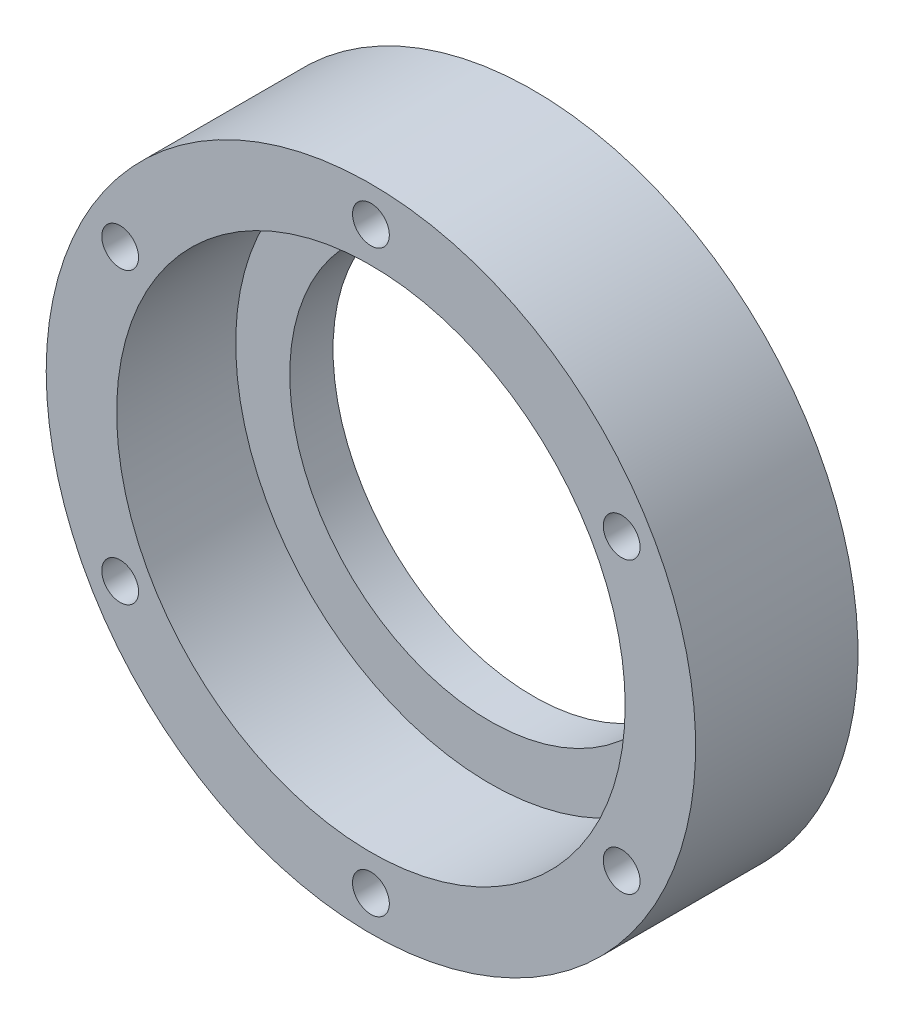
from build123d import *

# Parameters (mm, degrees)
SKETCH1_W             = 30
SKETCH1_H             = 15
F_4_CLEARANCE_HOLE1_D = 3.4
HOLE1_D               = 37
HOLE1_CBORE_D         = 46.98238
HOLE1_CBORE_DEPTH     = 11
CHAMFER1_SIZE         = 1.45


with BuildPart() as part:
    # Sketch1 → Revolve1 (revolve)
    with BuildSketch(Plane.XZ, mode=Mode.PRIVATE) as revolve1_sk:
        with Locations((15, 7.5)):
            Rectangle(SKETCH1_W, SKETCH1_H)
    revolve(revolve1_sk.sketch.rotate(Axis((0, 0, 15), (0, 0, -1)), 180), axis=Axis((0, 0, 15), (0, 0, -1)))

    # 4 Clearance Hole1 (through all)
    with Locations(Plane(origin=(0, 0, 0), x_dir=(-1, 0, 0), z_dir=(0, 0, -1))):
        with Locations((-23.166179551, -13.375), (-23.166179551, 13.375), (0, 26.75), (23.166179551, -13.375), (0, -26.75), (23.166179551, 13.375)):
            Hole(F_4_CLEARANCE_HOLE1_D / 2)

    # Hole1 (through all)
    with Locations(Plane.XY.offset(15)):
        with Locations((0, 0)):
            CounterBoreHole(HOLE1_D / 2, HOLE1_CBORE_D / 2, HOLE1_CBORE_DEPTH)

    # Chamfer1
    chamfer1_edges = [part.edges().sort_by_distance(p)[0] for p in [
        (-24.866179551, 13.375, 0),
        (-1.7, -26.75, 0),
        (-24.866179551, -13.375, 0),
        (-1.7, 26.75, 0),
        (21.466179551, 13.375, 0),
        (21.466179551, -13.375, 0),
    ]]
    chamfer(chamfer1_edges, length=CHAMFER1_SIZE)


solid = part.part
